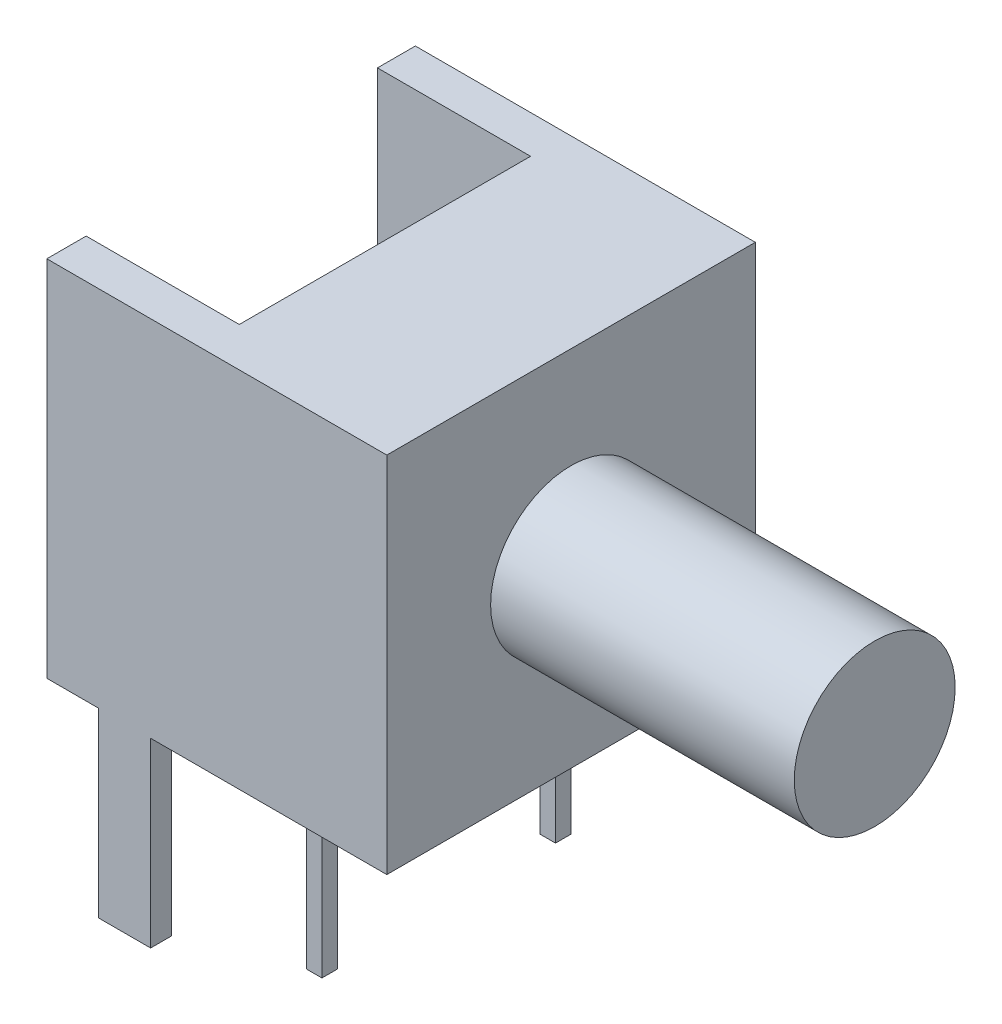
from build123d import *

# Parameters (mm, degrees)
SKETCH1_W           = 7.1
SKETCH1_H           = 7
BOSS_EXTRUDE1_DEPTH = 6.55
SKETCH2_W           = 0.3
SKETCH2_H           = 0.3
SKETCH2_W_2         = 1
SKETCH2_H_2         = 0.4
BOSS_EXTRUDE2_DEPTH = 3.5
SKETCH3_W           = 2.95
SKETCH3_H           = 5.612486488
CUT_EXTRUDE1_DEPTH  = 13.874587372
SKETCH4_R           = 1.55
BOSS_EXTRUDE3_DEPTH = 5.85


with BuildPart() as part:
    # Sketch1 → Boss-Extrude1 (new body)
    with BuildSketch(Plane(origin=(0, 0, 0), x_dir=(0, 0, -1), z_dir=(1, 0, 0))):
        Rectangle(SKETCH1_W, SKETCH1_H)
    extrude(amount=-BOSS_EXTRUDE1_DEPTH)

    # Sketch2 → Boss-Extrude2 (add)
    with BuildSketch(Plane.XZ.offset(3.5)):
        with Locations((-2.55, 2.25)):
            Rectangle(SKETCH2_W, SKETCH2_H)
        with Locations((-5.05, 3.35)):
            Rectangle(SKETCH2_W_2, SKETCH2_H_2)
    boss_extrude2 = extrude(amount=BOSS_EXTRUDE2_DEPTH)

    # Mirror1: Boss-Extrude2 across plane
    add(boss_extrude2.mirror(Plane.XY))

    # Sketch3 → Cut-Extrude1 (cut, through all)
    with BuildSketch(Plane(origin=(0, 3.5, 0), x_dir=(1, 0, 0), z_dir=(0, 1, 0))):
        with Locations((-5.075, 0.013867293)):
            Rectangle(SKETCH3_W, SKETCH3_H)
    extrude(amount=-CUT_EXTRUDE1_DEPTH, mode=Mode.SUBTRACT)

    # Sketch4 → Boss-Extrude3 (add)
    with BuildSketch(Plane(origin=(0, 0, 0), x_dir=(0, 0, -1), z_dir=(1, 0, 0))):
        with Locations(Location((0, 0, 0), (0, 0, 180))):
            Circle(SKETCH4_R)
    extrude(amount=BOSS_EXTRUDE3_DEPTH)


solid = part.part
